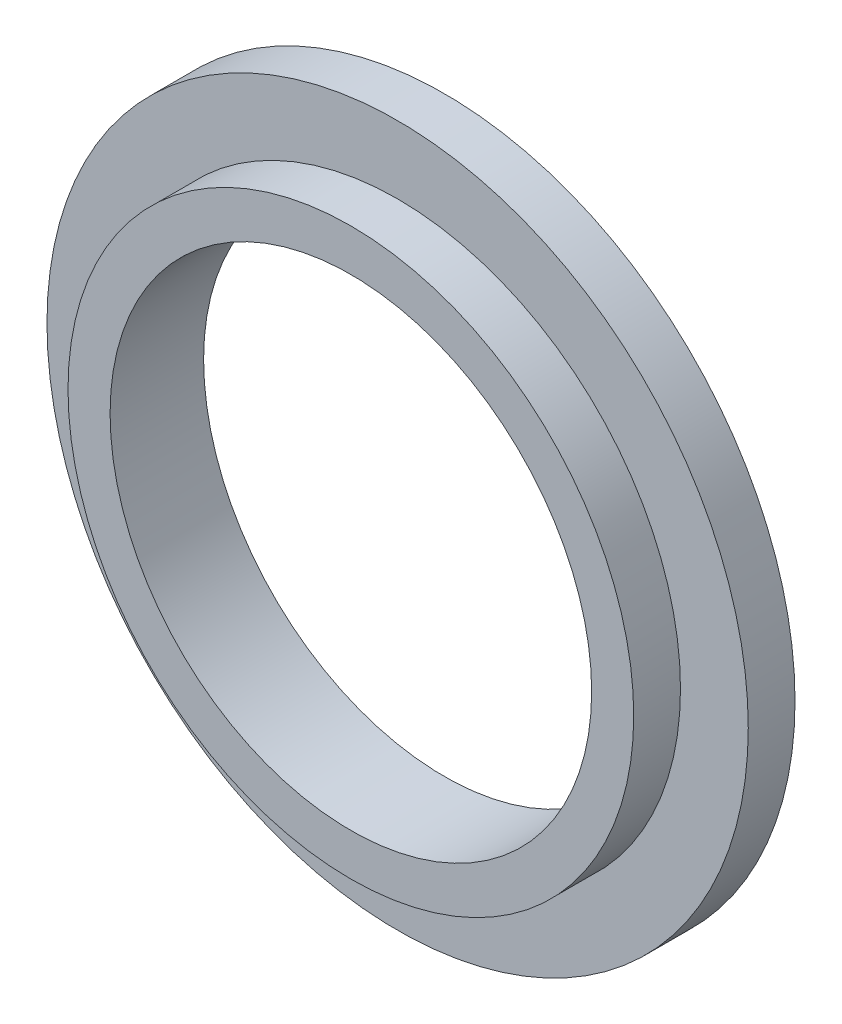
ISO-10303-21;
HEADER;
FILE_DESCRIPTION(('STEP AP214'),'2;1');
FILE_NAME('part.step','',(''),(''),'','','');
FILE_SCHEMA(('AUTOMOTIVE_DESIGN { 1 0 10303 214 1 1 1 1 }'));
ENDSEC;
DATA;
#1=APPLICATION_CONTEXT('core data for automotive mechanical design processes');
#2=APPLICATION_PROTOCOL_DEFINITION('international standard','automotive_design',2000,#1);
#3=PRODUCT_CONTEXT('',#1,'mechanical');
#4=PRODUCT('Part','Part','',(#3));
#5=PRODUCT_RELATED_PRODUCT_CATEGORY('part','',(#4));
#6=PRODUCT_DEFINITION_FORMATION('','',#4);
#7=PRODUCT_DEFINITION_CONTEXT('part definition',#1,'design');
#8=PRODUCT_DEFINITION('design','',#6,#7);
#9=PRODUCT_DEFINITION_SHAPE('','',#8);
#10=(LENGTH_UNIT() NAMED_UNIT(*) SI_UNIT(.MILLI.,.METRE.));
#11=(NAMED_UNIT(*) PLANE_ANGLE_UNIT() SI_UNIT($,.RADIAN.));
#12=(NAMED_UNIT(*) SI_UNIT($,.STERADIAN.) SOLID_ANGLE_UNIT());
#13=UNCERTAINTY_MEASURE_WITH_UNIT(LENGTH_MEASURE(1.E-05),#10,'distance_accuracy_value','');
#14=(GEOMETRIC_REPRESENTATION_CONTEXT(3) GLOBAL_UNCERTAINTY_ASSIGNED_CONTEXT((#13)) GLOBAL_UNIT_ASSIGNED_CONTEXT((#10,
#11,#12)) REPRESENTATION_CONTEXT('',''));
#15=CARTESIAN_POINT('',(0.,0.,0.));
#16=DIRECTION('',(0.,0.,1.));
#17=DIRECTION('',(1.,0.,0.));
#18=AXIS2_PLACEMENT_3D('',#15,#16,#17);
#19=CARTESIAN_POINT('',(-30.6252380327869,42.4041757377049,1.));
#20=DIRECTION('',(0.,0.,-1.));
#21=DIRECTION('',(-1.,0.,0.));
#22=AXIS2_PLACEMENT_3D('',#19,#20,#21);
#23=CYLINDRICAL_SURFACE('',#22,5.15);
#24=CARTESIAN_POINT('',(-30.6252380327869,42.4041757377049,1.));
#25=DIRECTION('',(0.,0.,1.));
#26=DIRECTION('',(1.,0.,0.));
#27=AXIS2_PLACEMENT_3D('',#24,#25,#26);
#28=CIRCLE('',#27,5.15);
#29=CARTESIAN_POINT('',(-25.4752380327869,42.4041757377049,1.));
#30=VERTEX_POINT('',#29);
#31=EDGE_CURVE('E42',#30,#30,#28,.T.);
#32=ORIENTED_EDGE('',*,*,#31,.T.);
#33=EDGE_LOOP('',(#32));
#34=FACE_BOUND('',#33,.T.);
#35=CARTESIAN_POINT('',(-30.6252380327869,42.4041757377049,-1.));
#36=DIRECTION('',(0.,0.,1.));
#37=DIRECTION('',(1.,0.,0.));
#38=AXIS2_PLACEMENT_3D('',#35,#36,#37);
#39=CIRCLE('',#38,5.15);
#40=CARTESIAN_POINT('',(-25.4752380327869,42.4041757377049,-1.));
#41=VERTEX_POINT('',#40);
#42=EDGE_CURVE('E52',#41,#41,#39,.T.);
#43=ORIENTED_EDGE('',*,*,#42,.F.);
#44=EDGE_LOOP('',(#43));
#45=FACE_BOUND('',#44,.T.);
#46=ADVANCED_FACE('F35',(#34,#45),#23,.F.);
#47=CARTESIAN_POINT('',(-30.6252380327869,42.4041757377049,1.));
#48=DIRECTION('',(0.,0.,-1.));
#49=DIRECTION('',(-1.,0.,0.));
#50=AXIS2_PLACEMENT_3D('',#47,#48,#49);
#51=CYLINDRICAL_SURFACE('',#50,6.05);
#52=CARTESIAN_POINT('',(-30.6252380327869,42.4041757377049,1.));
#53=DIRECTION('',(0.,0.,1.));
#54=DIRECTION('',(1.,0.,0.));
#55=AXIS2_PLACEMENT_3D('',#52,#53,#54);
#56=CIRCLE('',#55,6.05);
#57=CARTESIAN_POINT('',(-24.5752380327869,42.4041757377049,1.));
#58=VERTEX_POINT('',#57);
#59=EDGE_CURVE('E10',#58,#58,#56,.T.);
#60=ORIENTED_EDGE('',*,*,#59,.F.);
#61=EDGE_LOOP('',(#60));
#62=FACE_BOUND('',#61,.T.);
#63=CARTESIAN_POINT('',(-30.6252380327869,42.4041757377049,0.));
#64=DIRECTION('',(0.,0.,1.));
#65=DIRECTION('',(1.,0.,0.));
#66=AXIS2_PLACEMENT_3D('',#63,#64,#65);
#67=CIRCLE('',#66,6.05);
#68=CARTESIAN_POINT('',(-24.5752380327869,42.4041757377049,0.));
#69=VERTEX_POINT('',#68);
#70=EDGE_CURVE('E38',#69,#69,#67,.T.);
#71=ORIENTED_EDGE('',*,*,#70,.T.);
#72=EDGE_LOOP('',(#71));
#73=FACE_BOUND('',#72,.T.);
#74=ADVANCED_FACE('F69',(#62,#73),#51,.T.);
#75=CARTESIAN_POINT('',(0.,0.,1.));
#76=DIRECTION('',(0.,0.,1.));
#77=DIRECTION('',(1.,0.,0.));
#78=AXIS2_PLACEMENT_3D('',#75,#76,#77);
#79=PLANE('',#78);
#80=ORIENTED_EDGE('',*,*,#31,.F.);
#81=EDGE_LOOP('',(#80));
#82=FACE_BOUND('',#81,.T.);
#83=ORIENTED_EDGE('',*,*,#59,.T.);
#84=EDGE_LOOP('',(#83));
#85=FACE_BOUND('',#84,.T.);
#86=ADVANCED_FACE('F74',(#82,#85),#79,.T.);
#87=CARTESIAN_POINT('',(-30.6252380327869,42.4041757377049,-1.));
#88=DIRECTION('',(0.,0.,1.));
#89=DIRECTION('',(1.,0.,0.));
#90=AXIS2_PLACEMENT_3D('',#87,#88,#89);
#91=CYLINDRICAL_SURFACE('',#90,7.5);
#92=CARTESIAN_POINT('',(-30.6252380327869,42.4041757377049,-1.));
#93=DIRECTION('',(0.,0.,1.));
#94=DIRECTION('',(1.,0.,0.));
#95=AXIS2_PLACEMENT_3D('',#92,#93,#94);
#96=CIRCLE('',#95,7.5);
#97=CARTESIAN_POINT('',(-23.1252380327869,42.4041757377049,-1.));
#98=VERTEX_POINT('',#97);
#99=EDGE_CURVE('E51',#98,#98,#96,.T.);
#100=ORIENTED_EDGE('',*,*,#99,.T.);
#101=EDGE_LOOP('',(#100));
#102=FACE_BOUND('',#101,.T.);
#103=CARTESIAN_POINT('',(-30.6252380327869,42.4041757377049,0.));
#104=DIRECTION('',(0.,0.,1.));
#105=DIRECTION('',(1.,0.,0.));
#106=AXIS2_PLACEMENT_3D('',#103,#104,#105);
#107=CIRCLE('',#106,7.5);
#108=CARTESIAN_POINT('',(-23.1252380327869,42.4041757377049,0.));
#109=VERTEX_POINT('',#108);
#110=EDGE_CURVE('E48',#109,#109,#107,.T.);
#111=ORIENTED_EDGE('',*,*,#110,.F.);
#112=EDGE_LOOP('',(#111));
#113=FACE_BOUND('',#112,.T.);
#114=ADVANCED_FACE('F58',(#102,#113),#91,.T.);
#115=CARTESIAN_POINT('',(0.,0.,-1.));
#116=DIRECTION('',(0.,0.,1.));
#117=DIRECTION('',(1.,0.,0.));
#118=AXIS2_PLACEMENT_3D('',#115,#116,#117);
#119=PLANE('',#118);
#120=ORIENTED_EDGE('',*,*,#99,.F.);
#121=EDGE_LOOP('',(#120));
#122=FACE_BOUND('',#121,.T.);
#123=ORIENTED_EDGE('',*,*,#42,.T.);
#124=EDGE_LOOP('',(#123));
#125=FACE_BOUND('',#124,.T.);
#126=ADVANCED_FACE('F61',(#122,#125),#119,.F.);
#127=CARTESIAN_POINT('',(0.,0.,0.));
#128=DIRECTION('',(0.,0.,1.));
#129=DIRECTION('',(1.,0.,0.));
#130=AXIS2_PLACEMENT_3D('',#127,#128,#129);
#131=PLANE('',#130);
#132=ORIENTED_EDGE('',*,*,#70,.F.);
#133=EDGE_LOOP('',(#132));
#134=FACE_BOUND('',#133,.T.);
#135=ORIENTED_EDGE('',*,*,#110,.T.);
#136=EDGE_LOOP('',(#135));
#137=FACE_BOUND('',#136,.T.);
#138=ADVANCED_FACE('F64',(#134,#137),#131,.T.);
#139=CLOSED_SHELL('',(#46,#74,#86,#114,#126,#138));
#140=MANIFOLD_SOLID_BREP('B2',#139);
#141=ADVANCED_BREP_SHAPE_REPRESENTATION('',(#18,#140),#14);
#142=SHAPE_DEFINITION_REPRESENTATION(#9,#141);
ENDSEC;
END-ISO-10303-21;
